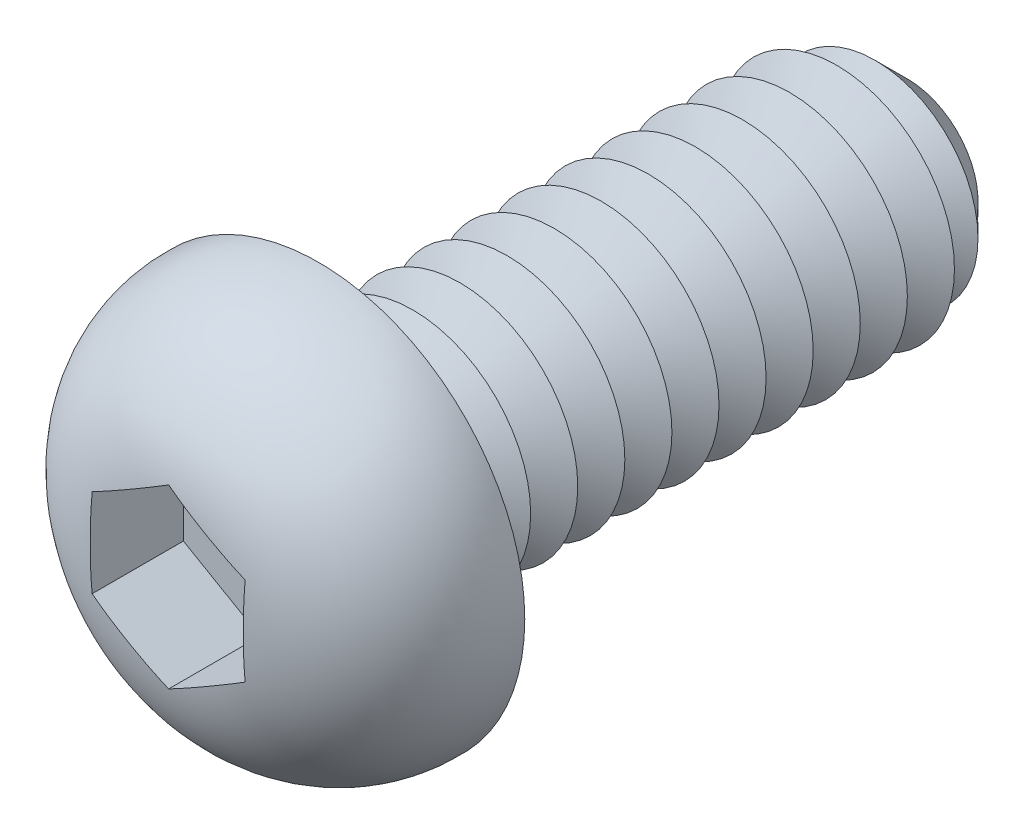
ISO-10303-21;
HEADER;
FILE_DESCRIPTION(('STEP AP214'),'2;1');
FILE_NAME('part.step','',(''),(''),'','','');
FILE_SCHEMA(('AUTOMOTIVE_DESIGN { 1 0 10303 214 1 1 1 1 }'));
ENDSEC;
DATA;
#1=APPLICATION_CONTEXT('core data for automotive mechanical design processes');
#2=APPLICATION_PROTOCOL_DEFINITION('international standard','automotive_design',2000,#1);
#3=PRODUCT_CONTEXT('',#1,'mechanical');
#4=PRODUCT('Part','Part','',(#3));
#5=PRODUCT_RELATED_PRODUCT_CATEGORY('part','',(#4));
#6=PRODUCT_DEFINITION_FORMATION('','',#4);
#7=PRODUCT_DEFINITION_CONTEXT('part definition',#1,'design');
#8=PRODUCT_DEFINITION('design','',#6,#7);
#9=PRODUCT_DEFINITION_SHAPE('','',#8);
#10=(LENGTH_UNIT() NAMED_UNIT(*) SI_UNIT(.MILLI.,.METRE.));
#11=(NAMED_UNIT(*) PLANE_ANGLE_UNIT() SI_UNIT($,.RADIAN.));
#12=(NAMED_UNIT(*) SI_UNIT($,.STERADIAN.) SOLID_ANGLE_UNIT());
#13=UNCERTAINTY_MEASURE_WITH_UNIT(LENGTH_MEASURE(1.E-05),#10,'distance_accuracy_value','');
#14=(GEOMETRIC_REPRESENTATION_CONTEXT(3) GLOBAL_UNCERTAINTY_ASSIGNED_CONTEXT((#13)) GLOBAL_UNIT_ASSIGNED_CONTEXT((#10,
#11,#12)) REPRESENTATION_CONTEXT('',''));
#15=CARTESIAN_POINT('',(0.,0.,0.));
#16=DIRECTION('',(0.,0.,1.));
#17=DIRECTION('',(1.,0.,0.));
#18=AXIS2_PLACEMENT_3D('',#15,#16,#17);
#19=CARTESIAN_POINT('',(0.,0.,-5.));
#20=DIRECTION('',(0.,0.,1.));
#21=DIRECTION('',(1.,0.,0.));
#22=AXIS2_PLACEMENT_3D('',#19,#20,#21);
#23=CYLINDRICAL_SURFACE('',#22,1.);
#24=CARTESIAN_POINT('',(0.,0.,-0.2));
#25=DIRECTION('',(0.,0.,1.));
#26=DIRECTION('',(1.,0.,0.));
#27=AXIS2_PLACEMENT_3D('',#24,#25,#26);
#28=CIRCLE('',#27,1.);
#29=CARTESIAN_POINT('',(1.,0.,-0.2));
#30=VERTEX_POINT('',#29);
#31=EDGE_CURVE('E48',#30,#30,#28,.F.);
#32=ORIENTED_EDGE('',*,*,#31,.T.);
#33=EDGE_LOOP('',(#32));
#34=FACE_BOUND('',#33,.T.);
#35=CARTESIAN_POINT('',(0.,0.,-0.399999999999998));
#36=DIRECTION('',(0.,0.,1.));
#37=DIRECTION('',(1.,0.,0.));
#38=AXIS2_PLACEMENT_3D('',#35,#36,#37);
#39=CIRCLE('',#38,1.);
#40=CARTESIAN_POINT('',(1.,0.,-0.399999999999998));
#41=VERTEX_POINT('',#40);
#42=EDGE_CURVE('E118',#41,#41,#39,.T.);
#43=ORIENTED_EDGE('',*,*,#42,.T.);
#44=EDGE_LOOP('',(#43));
#45=FACE_BOUND('',#44,.T.);
#46=ADVANCED_FACE('F39',(#34,#45),#23,.T.);
#47=CARTESIAN_POINT('',(0.,1.75,0.));
#48=DIRECTION('',(0.,0.,1.));
#49=DIRECTION('',(1.,0.,0.));
#50=AXIS2_PLACEMENT_3D('',#47,#48,#49);
#51=PLANE('',#50);
#52=CARTESIAN_POINT('',(0.,0.,0.));
#53=DIRECTION('',(0.,0.,1.));
#54=DIRECTION('',(1.,0.,0.));
#55=AXIS2_PLACEMENT_3D('',#52,#53,#54);
#56=CIRCLE('',#55,1.2);
#57=CARTESIAN_POINT('',(1.2,0.,0.));
#58=VERTEX_POINT('',#57);
#59=EDGE_CURVE('E11',#58,#58,#56,.T.);
#60=ORIENTED_EDGE('',*,*,#59,.T.);
#61=EDGE_LOOP('',(#60));
#62=FACE_BOUND('',#61,.T.);
#63=CARTESIAN_POINT('',(0.,0.,0.));
#64=DIRECTION('',(0.,0.,1.));
#65=DIRECTION('',(1.,0.,0.));
#66=AXIS2_PLACEMENT_3D('',#63,#64,#65);
#67=CIRCLE('',#66,1.75);
#68=CARTESIAN_POINT('',(1.75,0.,0.));
#69=VERTEX_POINT('',#68);
#70=EDGE_CURVE('E141',#69,#69,#67,.T.);
#71=ORIENTED_EDGE('',*,*,#70,.F.);
#72=EDGE_LOOP('',(#71));
#73=FACE_BOUND('',#72,.T.);
#74=ADVANCED_FACE('F223',(#62,#73),#51,.F.);
#75=CARTESIAN_POINT('',(0.,0.,0.0499999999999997));
#76=DIRECTION('',(0.,0.,1.));
#77=DIRECTION('',(1.,0.,0.));
#78=AXIS2_PLACEMENT_3D('',#75,#76,#77);
#79=DEGENERATE_TOROIDAL_SURFACE('',#78,0.50100040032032,1.25,.T.);
#80=CARTESIAN_POINT('',(-0.6502,0.375162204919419,1.2748120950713));
#81=CARTESIAN_POINT('',(-0.623166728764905,0.390769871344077,1.27799168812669));
#82=CARTESIAN_POINT('',(-0.596087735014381,0.406403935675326,1.28057383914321));
#83=CARTESIAN_POINT('',(-0.541883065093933,0.437699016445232,1.28476453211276));
#84=CARTESIAN_POINT('',(-0.514757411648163,0.453360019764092,1.28637345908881));
#85=CARTESIAN_POINT('',(-0.460533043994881,0.484666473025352,1.288838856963));
#86=CARTESIAN_POINT('',(-0.433434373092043,0.500311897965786,1.28969671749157));
#87=CARTESIAN_POINT('',(-0.379223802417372,0.531610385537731,1.29082127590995));
#88=CARTESIAN_POINT('',(-0.352111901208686,0.547263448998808,1.29108787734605));
#89=CARTESIAN_POINT('',(-0.297888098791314,0.578569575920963,1.29108787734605));
#90=CARTESIAN_POINT('',(-0.270776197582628,0.59422263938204,1.29082127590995));
#91=CARTESIAN_POINT('',(-0.216565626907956,0.625521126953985,1.28969671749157));
#92=CARTESIAN_POINT('',(-0.189466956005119,0.641166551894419,1.288838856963));
#93=CARTESIAN_POINT('',(-0.135242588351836,0.672473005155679,1.28637345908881));
#94=CARTESIAN_POINT('',(-0.108116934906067,0.688134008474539,1.28476453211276));
#95=CARTESIAN_POINT('',(-0.0539122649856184,0.719429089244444,1.28057383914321));
#96=CARTESIAN_POINT('',(-0.0268332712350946,0.735063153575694,1.27799168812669));
#97=CARTESIAN_POINT('',(0.000200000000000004,0.750670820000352,1.2748120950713));
#98=B_SPLINE_CURVE_WITH_KNOTS('',3,(#80,#81,#82,#83,#84,#85,#86,#87,#88,#89,#90,#91,#92,#93,#94,
#95,#96,#97),.UNSPECIFIED.,.F.,.F.,(4,2,2,2,2,2,2,2,4),(0.,0.0941133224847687,0.188189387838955,
0.282091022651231,0.376007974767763,0.469924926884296,0.563826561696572,0.657902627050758,
0.752015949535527),.UNSPECIFIED.);
#99=CARTESIAN_POINT('',(-0.65,0.375277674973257,1.27483563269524));
#100=VERTEX_POINT('',#99);
#101=CARTESIAN_POINT('',(0.,0.750555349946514,1.27483563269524));
#102=VERTEX_POINT('',#101);
#103=EDGE_CURVE('E158',#100,#102,#98,.T.);
#104=ORIENTED_EDGE('',*,*,#103,.T.);
#105=CARTESIAN_POINT('',(-0.000199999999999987,0.750670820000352,1.2748120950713));
#106=CARTESIAN_POINT('',(0.0268332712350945,0.735063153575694,1.27799168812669));
#107=CARTESIAN_POINT('',(0.0539122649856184,0.719429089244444,1.28057383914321));
#108=CARTESIAN_POINT('',(0.108116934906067,0.688134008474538,1.28476453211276));
#109=CARTESIAN_POINT('',(0.135242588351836,0.672473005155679,1.28637345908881));
#110=CARTESIAN_POINT('',(0.189466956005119,0.641166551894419,1.288838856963));
#111=CARTESIAN_POINT('',(0.216565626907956,0.625521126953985,1.28969671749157));
#112=CARTESIAN_POINT('',(0.270776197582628,0.59422263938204,1.29082127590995));
#113=CARTESIAN_POINT('',(0.297888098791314,0.578569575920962,1.29108787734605));
#114=CARTESIAN_POINT('',(0.352111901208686,0.547263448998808,1.29108787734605));
#115=CARTESIAN_POINT('',(0.379223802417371,0.531610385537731,1.29082127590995));
#116=CARTESIAN_POINT('',(0.433434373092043,0.500311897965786,1.28969671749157));
#117=CARTESIAN_POINT('',(0.46053304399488,0.484666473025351,1.288838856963));
#118=CARTESIAN_POINT('',(0.514757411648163,0.453360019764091,1.28637345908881));
#119=CARTESIAN_POINT('',(0.541883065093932,0.437699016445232,1.28476453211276));
#120=CARTESIAN_POINT('',(0.596087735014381,0.406403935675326,1.28057383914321));
#121=CARTESIAN_POINT('',(0.623166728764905,0.390769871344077,1.27799168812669));
#122=CARTESIAN_POINT('',(0.6502,0.375162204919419,1.2748120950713));
#123=B_SPLINE_CURVE_WITH_KNOTS('',3,(#105,#106,#107,#108,#109,#110,#111,#112,#113,#114,#115,
#116,#117,#118,#119,#120,#121,#122),.UNSPECIFIED.,.F.,.F.,(4,2,2,2,2,2,2,2,4),(0.,
0.0941133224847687,0.188189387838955,0.282091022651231,0.376007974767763,0.469924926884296,
0.563826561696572,0.657902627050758,0.752015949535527),.UNSPECIFIED.);
#124=CARTESIAN_POINT('',(0.65,0.375277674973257,1.27483563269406));
#125=VERTEX_POINT('',#124);
#126=EDGE_CURVE('E98',#102,#125,#123,.T.);
#127=ORIENTED_EDGE('',*,*,#126,.T.);
#128=CARTESIAN_POINT('',(0.65,0.,1.29108787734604));
#129=CARTESIAN_POINT('',(0.65,-0.0548046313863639,1.29109436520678));
#130=CARTESIAN_POINT('',(0.65,-0.109608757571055,1.29030350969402));
#131=CARTESIAN_POINT('',(0.65,-0.219170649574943,1.28661520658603));
#132=CARTESIAN_POINT('',(0.65,-0.273928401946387,1.28371727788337));
#133=CARTESIAN_POINT('',(0.65,-0.383095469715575,1.27460340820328));
#134=CARTESIAN_POINT('',(0.65,-0.437505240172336,1.26839356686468));
#135=CARTESIAN_POINT('',(0.65,-0.545599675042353,1.25147686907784));
#136=CARTESIAN_POINT('',(0.65,-0.599284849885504,1.24077336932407));
#137=CARTESIAN_POINT('',(0.65,-0.726147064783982,1.20871234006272));
#138=CARTESIAN_POINT('',(0.65,-0.79872007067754,1.18482363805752));
#139=CARTESIAN_POINT('',(0.65,-0.939044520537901,1.12544321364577));
#140=CARTESIAN_POINT('',(0.65,-1.00679500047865,1.08994917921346));
#141=CARTESIAN_POINT('',(0.65,-1.13535055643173,1.00723279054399));
#142=CARTESIAN_POINT('',(0.65,-1.19611172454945,0.959941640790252));
#143=CARTESIAN_POINT('',(0.65,-1.30775435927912,0.854818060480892));
#144=CARTESIAN_POINT('',(0.65,-1.35863681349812,0.796986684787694));
#145=CARTESIAN_POINT('',(0.65,-1.44408820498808,0.678594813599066));
#146=CARTESIAN_POINT('',(0.65,-1.4797502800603,0.618820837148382));
#147=CARTESIAN_POINT('',(0.65,-1.53998909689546,0.493937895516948));
#148=CARTESIAN_POINT('',(0.65,-1.56457069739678,0.428831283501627));
#149=CARTESIAN_POINT('',(0.65,-1.60096350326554,0.298259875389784));
#150=CARTESIAN_POINT('',(0.65,-1.61329238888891,0.232938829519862));
#151=CARTESIAN_POINT('',(0.65,-1.62664623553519,0.101147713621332));
#152=CARTESIAN_POINT('',(0.65,-1.6276715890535,0.0346776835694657));
#153=CARTESIAN_POINT('',(0.65,-1.6184464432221,-0.0965779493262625));
#154=CARTESIAN_POINT('',(0.65,-1.60834630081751,-0.161374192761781));
#155=CARTESIAN_POINT('',(0.65,-1.57743533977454,-0.288341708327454));
#156=CARTESIAN_POINT('',(0.65,-1.55662692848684,-0.350513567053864));
#157=CARTESIAN_POINT('',(0.65,-1.50490327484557,-0.470651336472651));
#158=CARTESIAN_POINT('',(0.65,-1.47396668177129,-0.528608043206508));
#159=CARTESIAN_POINT('',(0.65,-1.40295285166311,-0.63865943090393));
#160=CARTESIAN_POINT('',(0.65,-1.36286988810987,-0.690750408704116));
#161=CARTESIAN_POINT('',(0.65,-1.27395593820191,-0.788697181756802));
#162=CARTESIAN_POINT('',(0.65,-1.22497034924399,-0.834412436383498));
#163=CARTESIAN_POINT('',(0.65,-1.12042496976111,-0.917345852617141));
#164=CARTESIAN_POINT('',(0.65,-1.06487498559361,-0.954576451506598));
#165=CARTESIAN_POINT('',(0.65,-0.945822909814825,-1.02180899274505));
#166=CARTESIAN_POINT('',(0.65,-0.882060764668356,-1.05135028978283));
#167=CARTESIAN_POINT('',(0.65,-0.783687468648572,-1.08845195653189));
#168=CARTESIAN_POINT('',(0.65,-0.750379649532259,-1.09963089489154));
#169=CARTESIAN_POINT('',(0.65,-0.683093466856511,-1.11968224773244));
#170=CARTESIAN_POINT('',(0.65,-0.64911549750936,-1.12855597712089));
#171=CARTESIAN_POINT('',(0.65,-0.573025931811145,-1.14591124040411));
#172=CARTESIAN_POINT('',(0.65,-0.530794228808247,-1.15386155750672));
#173=CARTESIAN_POINT('',(0.65,-0.445896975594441,-1.16700727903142));
#174=CARTESIAN_POINT('',(0.65,-0.40323122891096,-1.17220137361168));
#175=CARTESIAN_POINT('',(0.65,-0.317562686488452,-1.18041063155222));
#176=CARTESIAN_POINT('',(0.65,-0.274559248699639,-1.18341875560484));
#177=CARTESIAN_POINT('',(0.65,-0.188468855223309,-1.18783962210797));
#178=CARTESIAN_POINT('',(0.65,-0.145381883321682,-1.1892520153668));
#179=CARTESIAN_POINT('',(0.65,-0.0590019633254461,-1.19095450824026));
#180=CARTESIAN_POINT('',(0.65,-0.0157089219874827,-1.19123978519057));
#181=CARTESIAN_POINT('',(0.65,0.0708684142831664,-1.1907952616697));
#182=CARTESIAN_POINT('',(0.65,0.114152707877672,-1.19006535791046));
#183=CARTESIAN_POINT('',(0.65,0.243756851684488,-1.18593769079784));
#184=CARTESIAN_POINT('',(0.65,0.330069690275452,-1.18060873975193));
#185=CARTESIAN_POINT('',(0.65,0.455654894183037,-1.16558903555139));
#186=CARTESIAN_POINT('',(0.65,0.495371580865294,-1.1597609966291));
#187=CARTESIAN_POINT('',(0.65,0.574346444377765,-1.14554740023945));
#188=CARTESIAN_POINT('',(0.65,0.613604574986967,-1.13716158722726));
#189=CARTESIAN_POINT('',(0.65,0.729813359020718,-1.10777161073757));
#190=CARTESIAN_POINT('',(0.65,0.805761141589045,-1.0824785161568));
#191=CARTESIAN_POINT('',(0.65,0.953092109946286,-1.01876094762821));
#192=CARTESIAN_POINT('',(0.65,1.02440985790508,-0.980183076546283));
#193=CARTESIAN_POINT('',(0.65,1.15871394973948,-0.890064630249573));
#194=CARTESIAN_POINT('',(0.65,1.22167627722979,-0.838487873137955));
#195=CARTESIAN_POINT('',(0.65,1.330165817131,-0.729868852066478));
#196=CARTESIAN_POINT('',(0.649999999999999,1.37682604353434,-0.673955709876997));
#197=CARTESIAN_POINT('',(0.649999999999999,1.45915796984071,-0.554638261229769));
#198=CARTESIAN_POINT('',(0.649999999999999,1.49484555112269,-0.491244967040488));
#199=CARTESIAN_POINT('',(0.649999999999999,1.55177809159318,-0.363813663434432));
#200=CARTESIAN_POINT('',(0.649999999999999,1.57388655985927,-0.300159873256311));
#201=CARTESIAN_POINT('',(0.649999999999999,1.60682450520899,-0.169982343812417));
#202=CARTESIAN_POINT('',(0.649999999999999,1.61765327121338,-0.103458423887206));
#203=CARTESIAN_POINT('',(0.649999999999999,1.62754441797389,0.0288862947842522));
#204=CARTESIAN_POINT('',(0.649999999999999,1.6268761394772,0.0946871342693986));
#205=CARTESIAN_POINT('',(0.649999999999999,1.61445465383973,0.225228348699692));
#206=CARTESIAN_POINT('',(0.649999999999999,1.60270257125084,0.289968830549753));
#207=CARTESIAN_POINT('',(0.649999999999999,1.56855547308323,0.416311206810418));
#208=CARTESIAN_POINT('',(0.649999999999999,1.54620091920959,0.477924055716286));
#209=CARTESIAN_POINT('',(0.649999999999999,1.49157336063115,0.596573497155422));
#210=CARTESIAN_POINT('',(0.649999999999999,1.459300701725,0.6536102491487));
#211=CARTESIAN_POINT('',(0.649999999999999,1.38544036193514,0.762206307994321));
#212=CARTESIAN_POINT('',(0.65,1.34375441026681,0.813698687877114));
#213=CARTESIAN_POINT('',(0.65,1.25257593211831,0.909229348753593));
#214=CARTESIAN_POINT('',(0.65,1.20308164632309,0.953265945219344));
#215=CARTESIAN_POINT('',(0.65,1.09600377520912,1.03435686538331));
#216=CARTESIAN_POINT('',(0.65,1.0382019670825,1.07112203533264));
#217=CARTESIAN_POINT('',(0.65,0.917680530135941,1.13527918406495));
#218=CARTESIAN_POINT('',(0.65,0.854963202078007,1.16267551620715));
#219=CARTESIAN_POINT('',(0.65,0.743153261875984,1.20242953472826));
#220=CARTESIAN_POINT('',(0.65,0.69477028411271,1.21684578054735));
#221=CARTESIAN_POINT('',(0.65,0.596867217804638,1.24115086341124));
#222=CARTESIAN_POINT('',(0.65,0.547346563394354,1.25103739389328));
#223=CARTESIAN_POINT('',(0.65,0.397729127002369,1.27492295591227));
#224=CARTESIAN_POINT('',(0.65,0.296733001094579,1.28309757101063));
#225=CARTESIAN_POINT('',(0.65,0.163130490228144,1.28863783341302));
#226=CARTESIAN_POINT('',(0.65,0.130510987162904,1.28957449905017));
#227=CARTESIAN_POINT('',(0.65,0.0652609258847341,1.29079749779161));
#228=CARTESIAN_POINT('',(0.65,0.0326303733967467,1.29108401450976));
#229=CARTESIAN_POINT('',(0.65,0.,1.29108787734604));
#230=B_SPLINE_CURVE_WITH_KNOTS('',3,(#128,#129,#130,#131,#132,#133,#134,#135,#136,#137,#138,
#139,#140,#141,#142,#143,#144,#145,#146,#147,#148,#149,#150,#151,#152,#153,#154,#155,#156,#157,
#158,#159,#160,#161,#162,#163,#164,#165,#166,#167,#168,#169,#170,#171,#172,#173,#174,#175,#176,
#177,#178,#179,#180,#181,#182,#183,#184,#185,#186,#187,#188,#189,#190,#191,#192,#193,#194,#195,
#196,#197,#198,#199,#200,#201,#202,#203,#204,#205,#206,#207,#208,#209,#210,#211,#212,#213,#214,
#215,#216,#217,#218,#219,#220,#221,#222,#223,#224,#225,#226,#227,#228,#229),.UNSPECIFIED.,.T.,
.F.,(4,2,2,2,2,2,2,2,2,2,2,2,2,2,2,2,2,2,2,2,2,2,2,2,2,2,2,2,2,2,2,2,2,2,2,2,2,2,2,2,2,2,2,2,2,
2,2,2,2,2,4),(0.,0.164404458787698,0.328846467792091,0.492986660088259,0.657004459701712,
0.885283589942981,1.11360822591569,1.34329681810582,1.57296243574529,1.78072081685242,
1.9883880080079,2.18685176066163,2.38530862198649,2.58111595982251,2.77687929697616,
2.97305799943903,3.16935986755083,3.36946935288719,3.5692835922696,3.77920028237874,
3.88453412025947,3.98980774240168,4.11861722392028,4.24748786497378,4.37677168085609,
4.50608378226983,4.63594858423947,4.76582660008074,5.02485743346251,5.14520715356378,
5.26556890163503,5.5046106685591,5.74651068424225,5.98909160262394,6.20640136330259,
6.42339510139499,6.62456294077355,6.82574346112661,7.02221748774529,7.21867158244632,
7.41438191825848,7.61008543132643,7.80793510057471,8.00582941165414,8.21046898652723,
8.41501334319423,8.56624321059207,8.71754999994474,9.02064941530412,9.11856257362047,
9.21644807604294),.UNSPECIFIED.);
#231=CARTESIAN_POINT('',(0.65,-0.375277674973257,1.27483563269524));
#232=VERTEX_POINT('',#231);
#233=EDGE_CURVE('E63',#125,#232,#230,.T.);
#234=ORIENTED_EDGE('',*,*,#233,.T.);
#235=CARTESIAN_POINT('',(0.6502,-0.375162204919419,1.2748120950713));
#236=CARTESIAN_POINT('',(0.623166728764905,-0.390769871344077,1.27799168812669));
#237=CARTESIAN_POINT('',(0.596087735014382,-0.406403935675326,1.28057383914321));
#238=CARTESIAN_POINT('',(0.541883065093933,-0.437699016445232,1.28476453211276));
#239=CARTESIAN_POINT('',(0.514757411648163,-0.453360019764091,1.28637345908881));
#240=CARTESIAN_POINT('',(0.460533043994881,-0.484666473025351,1.288838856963));
#241=CARTESIAN_POINT('',(0.433434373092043,-0.500311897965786,1.28969671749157));
#242=CARTESIAN_POINT('',(0.379223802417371,-0.531610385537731,1.29082127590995));
#243=CARTESIAN_POINT('',(0.352111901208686,-0.547263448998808,1.29108787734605));
#244=CARTESIAN_POINT('',(0.297888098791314,-0.578569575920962,1.29108787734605));
#245=CARTESIAN_POINT('',(0.270776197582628,-0.59422263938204,1.29082127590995));
#246=CARTESIAN_POINT('',(0.216565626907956,-0.625521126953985,1.28969671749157));
#247=CARTESIAN_POINT('',(0.189466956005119,-0.641166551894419,1.288838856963));
#248=CARTESIAN_POINT('',(0.135242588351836,-0.672473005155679,1.28637345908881));
#249=CARTESIAN_POINT('',(0.108116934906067,-0.688134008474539,1.28476453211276));
#250=CARTESIAN_POINT('',(0.0539122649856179,-0.719429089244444,1.28057383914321));
#251=CARTESIAN_POINT('',(0.026833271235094,-0.735063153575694,1.27799168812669));
#252=CARTESIAN_POINT('',(-0.000200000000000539,-0.750670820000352,1.2748120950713));
#253=B_SPLINE_CURVE_WITH_KNOTS('',3,(#235,#236,#237,#238,#239,#240,#241,#242,#243,#244,#245,
#246,#247,#248,#249,#250,#251,#252),.UNSPECIFIED.,.F.,.F.,(4,2,2,2,2,2,2,2,4),(0.,
0.0941133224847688,0.188189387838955,0.282091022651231,0.376007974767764,0.469924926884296,
0.563826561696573,0.657902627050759,0.752015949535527),.UNSPECIFIED.);
#254=CARTESIAN_POINT('',(0.,-0.750555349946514,1.27483563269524));
#255=VERTEX_POINT('',#254);
#256=EDGE_CURVE('E244',#232,#255,#253,.T.);
#257=ORIENTED_EDGE('',*,*,#256,.T.);
#258=CARTESIAN_POINT('',(0.000199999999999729,-0.750670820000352,1.2748120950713));
#259=CARTESIAN_POINT('',(-0.0268332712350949,-0.735063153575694,1.27799168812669));
#260=CARTESIAN_POINT('',(-0.0539122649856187,-0.719429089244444,1.28057383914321));
#261=CARTESIAN_POINT('',(-0.108116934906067,-0.688134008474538,1.28476453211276));
#262=CARTESIAN_POINT('',(-0.135242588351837,-0.672473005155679,1.28637345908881));
#263=CARTESIAN_POINT('',(-0.18946695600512,-0.641166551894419,1.288838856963));
#264=CARTESIAN_POINT('',(-0.216565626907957,-0.625521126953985,1.28969671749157));
#265=CARTESIAN_POINT('',(-0.270776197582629,-0.59422263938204,1.29082127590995));
#266=CARTESIAN_POINT('',(-0.297888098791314,-0.578569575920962,1.29108787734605));
#267=CARTESIAN_POINT('',(-0.352111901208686,-0.547263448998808,1.29108787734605));
#268=CARTESIAN_POINT('',(-0.379223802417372,-0.531610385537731,1.29082127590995));
#269=CARTESIAN_POINT('',(-0.433434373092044,-0.500311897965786,1.28969671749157));
#270=CARTESIAN_POINT('',(-0.460533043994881,-0.484666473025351,1.288838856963));
#271=CARTESIAN_POINT('',(-0.514757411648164,-0.453360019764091,1.28637345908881));
#272=CARTESIAN_POINT('',(-0.541883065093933,-0.437699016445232,1.28476453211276));
#273=CARTESIAN_POINT('',(-0.596087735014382,-0.406403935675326,1.28057383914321));
#274=CARTESIAN_POINT('',(-0.623166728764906,-0.390769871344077,1.27799168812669));
#275=CARTESIAN_POINT('',(-0.6502,-0.375162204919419,1.2748120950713));
#276=B_SPLINE_CURVE_WITH_KNOTS('',3,(#258,#259,#260,#261,#262,#263,#264,#265,#266,#267,#268,
#269,#270,#271,#272,#273,#274,#275),.UNSPECIFIED.,.F.,.F.,(4,2,2,2,2,2,2,2,4),(0.,
0.0941133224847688,0.188189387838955,0.282091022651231,0.376007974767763,0.469924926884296,
0.563826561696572,0.657902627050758,0.752015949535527),.UNSPECIFIED.);
#277=CARTESIAN_POINT('',(-0.65,-0.375277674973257,1.27483563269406));
#278=VERTEX_POINT('',#277);
#279=EDGE_CURVE('E250',#255,#278,#276,.T.);
#280=ORIENTED_EDGE('',*,*,#279,.T.);
#281=CARTESIAN_POINT('',(-0.65,0.,1.29108787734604));
#282=CARTESIAN_POINT('',(-0.65,0.0548046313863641,1.29109436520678));
#283=CARTESIAN_POINT('',(-0.65,0.109608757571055,1.29030350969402));
#284=CARTESIAN_POINT('',(-0.65,0.219170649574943,1.28661520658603));
#285=CARTESIAN_POINT('',(-0.65,0.273928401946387,1.28371727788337));
#286=CARTESIAN_POINT('',(-0.65,0.383095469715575,1.27460340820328));
#287=CARTESIAN_POINT('',(-0.65,0.437505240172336,1.26839356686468));
#288=CARTESIAN_POINT('',(-0.65,0.545599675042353,1.25147686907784));
#289=CARTESIAN_POINT('',(-0.65,0.599284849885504,1.24077336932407));
#290=CARTESIAN_POINT('',(-0.65,0.726147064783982,1.20871234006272));
#291=CARTESIAN_POINT('',(-0.65,0.79872007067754,1.18482363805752));
#292=CARTESIAN_POINT('',(-0.65,0.939044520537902,1.12544321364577));
#293=CARTESIAN_POINT('',(-0.65,1.00679500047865,1.08994917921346));
#294=CARTESIAN_POINT('',(-0.65,1.13535055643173,1.00723279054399));
#295=CARTESIAN_POINT('',(-0.65,1.19611172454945,0.959941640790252));
#296=CARTESIAN_POINT('',(-0.65,1.30775435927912,0.854818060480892));
#297=CARTESIAN_POINT('',(-0.649999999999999,1.35863681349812,0.796986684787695));
#298=CARTESIAN_POINT('',(-0.649999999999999,1.44408820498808,0.678594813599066));
#299=CARTESIAN_POINT('',(-0.649999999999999,1.4797502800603,0.618820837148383));
#300=CARTESIAN_POINT('',(-0.649999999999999,1.53998909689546,0.493937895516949));
#301=CARTESIAN_POINT('',(-0.649999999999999,1.56457069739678,0.428831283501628));
#302=CARTESIAN_POINT('',(-0.649999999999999,1.60096350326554,0.298259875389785));
#303=CARTESIAN_POINT('',(-0.649999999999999,1.61329238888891,0.232938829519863));
#304=CARTESIAN_POINT('',(-0.649999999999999,1.62664623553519,0.101147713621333));
#305=CARTESIAN_POINT('',(-0.649999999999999,1.6276715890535,0.0346776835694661));
#306=CARTESIAN_POINT('',(-0.649999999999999,1.6184464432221,-0.0965779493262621));
#307=CARTESIAN_POINT('',(-0.649999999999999,1.60834630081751,-0.16137419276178));
#308=CARTESIAN_POINT('',(-0.649999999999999,1.57743533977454,-0.288341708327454));
#309=CARTESIAN_POINT('',(-0.649999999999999,1.55662692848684,-0.350513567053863));
#310=CARTESIAN_POINT('',(-0.649999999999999,1.50490327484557,-0.47065133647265));
#311=CARTESIAN_POINT('',(-0.649999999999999,1.47396668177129,-0.528608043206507));
#312=CARTESIAN_POINT('',(-0.649999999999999,1.40295285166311,-0.638659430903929));
#313=CARTESIAN_POINT('',(-0.649999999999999,1.36286988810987,-0.690750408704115));
#314=CARTESIAN_POINT('',(-0.649999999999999,1.27395593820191,-0.788697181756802));
#315=CARTESIAN_POINT('',(-0.65,1.22497034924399,-0.834412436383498));
#316=CARTESIAN_POINT('',(-0.65,1.12042496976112,-0.91734585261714));
#317=CARTESIAN_POINT('',(-0.65,1.06487498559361,-0.954576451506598));
#318=CARTESIAN_POINT('',(-0.65,0.945822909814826,-1.02180899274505));
#319=CARTESIAN_POINT('',(-0.65,0.882060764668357,-1.05135028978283));
#320=CARTESIAN_POINT('',(-0.65,0.783687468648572,-1.08845195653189));
#321=CARTESIAN_POINT('',(-0.65,0.75037964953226,-1.09963089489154));
#322=CARTESIAN_POINT('',(-0.65,0.683093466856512,-1.11968224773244));
#323=CARTESIAN_POINT('',(-0.65,0.649115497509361,-1.12855597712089));
#324=CARTESIAN_POINT('',(-0.65,0.573025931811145,-1.14591124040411));
#325=CARTESIAN_POINT('',(-0.65,0.530794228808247,-1.15386155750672));
#326=CARTESIAN_POINT('',(-0.65,0.445896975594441,-1.16700727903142));
#327=CARTESIAN_POINT('',(-0.65,0.40323122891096,-1.17220137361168));
#328=CARTESIAN_POINT('',(-0.65,0.317562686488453,-1.18041063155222));
#329=CARTESIAN_POINT('',(-0.65,0.27455924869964,-1.18341875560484));
#330=CARTESIAN_POINT('',(-0.65,0.18846885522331,-1.18783962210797));
#331=CARTESIAN_POINT('',(-0.65,0.145381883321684,-1.1892520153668));
#332=CARTESIAN_POINT('',(-0.65,0.0590019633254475,-1.19095450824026));
#333=CARTESIAN_POINT('',(-0.65,0.0157089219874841,-1.19123978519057));
#334=CARTESIAN_POINT('',(-0.65,-0.070868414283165,-1.1907952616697));
#335=CARTESIAN_POINT('',(-0.65,-0.114152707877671,-1.19006535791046));
#336=CARTESIAN_POINT('',(-0.65,-0.243756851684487,-1.18593769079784));
#337=CARTESIAN_POINT('',(-0.65,-0.330069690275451,-1.18060873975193));
#338=CARTESIAN_POINT('',(-0.65,-0.455654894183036,-1.16558903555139));
#339=CARTESIAN_POINT('',(-0.65,-0.495371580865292,-1.1597609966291));
#340=CARTESIAN_POINT('',(-0.65,-0.574346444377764,-1.14554740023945));
#341=CARTESIAN_POINT('',(-0.65,-0.613604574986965,-1.13716158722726));
#342=CARTESIAN_POINT('',(-0.65,-0.729813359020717,-1.10777161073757));
#343=CARTESIAN_POINT('',(-0.65,-0.805761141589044,-1.0824785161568));
#344=CARTESIAN_POINT('',(-0.65,-0.953092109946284,-1.01876094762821));
#345=CARTESIAN_POINT('',(-0.65,-1.02440985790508,-0.980183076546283));
#346=CARTESIAN_POINT('',(-0.65,-1.15871394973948,-0.890064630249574));
#347=CARTESIAN_POINT('',(-0.65,-1.22167627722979,-0.838487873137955));
#348=CARTESIAN_POINT('',(-0.65,-1.330165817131,-0.729868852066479));
#349=CARTESIAN_POINT('',(-0.65,-1.37682604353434,-0.673955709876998));
#350=CARTESIAN_POINT('',(-0.65,-1.45915796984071,-0.55463826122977));
#351=CARTESIAN_POINT('',(-0.65,-1.49484555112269,-0.49124496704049));
#352=CARTESIAN_POINT('',(-0.65,-1.55177809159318,-0.363813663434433));
#353=CARTESIAN_POINT('',(-0.65,-1.57388655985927,-0.300159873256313));
#354=CARTESIAN_POINT('',(-0.65,-1.60682450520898,-0.169982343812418));
#355=CARTESIAN_POINT('',(-0.65,-1.61765327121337,-0.103458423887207));
#356=CARTESIAN_POINT('',(-0.65,-1.62754441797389,0.0288862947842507));
#357=CARTESIAN_POINT('',(-0.65,-1.6268761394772,0.0946871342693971));
#358=CARTESIAN_POINT('',(-0.65,-1.61445465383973,0.22522834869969));
#359=CARTESIAN_POINT('',(-0.65,-1.60270257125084,0.289968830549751));
#360=CARTESIAN_POINT('',(-0.65,-1.56855547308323,0.416311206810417));
#361=CARTESIAN_POINT('',(-0.65,-1.54620091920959,0.477924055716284));
#362=CARTESIAN_POINT('',(-0.65,-1.49157336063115,0.596573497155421));
#363=CARTESIAN_POINT('',(-0.65,-1.459300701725,0.653610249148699));
#364=CARTESIAN_POINT('',(-0.65,-1.38544036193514,0.762206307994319));
#365=CARTESIAN_POINT('',(-0.65,-1.34375441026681,0.813698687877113));
#366=CARTESIAN_POINT('',(-0.65,-1.25257593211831,0.909229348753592));
#367=CARTESIAN_POINT('',(-0.65,-1.20308164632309,0.953265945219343));
#368=CARTESIAN_POINT('',(-0.65,-1.09600377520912,1.03435686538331));
#369=CARTESIAN_POINT('',(-0.65,-1.0382019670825,1.07112203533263));
#370=CARTESIAN_POINT('',(-0.65,-0.917680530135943,1.13527918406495));
#371=CARTESIAN_POINT('',(-0.65,-0.854963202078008,1.16267551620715));
#372=CARTESIAN_POINT('',(-0.65,-0.743153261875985,1.20242953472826));
#373=CARTESIAN_POINT('',(-0.65,-0.694770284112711,1.21684578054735));
#374=CARTESIAN_POINT('',(-0.65,-0.596867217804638,1.24115086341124));
#375=CARTESIAN_POINT('',(-0.65,-0.547346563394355,1.25103739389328));
#376=CARTESIAN_POINT('',(-0.65,-0.39772912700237,1.27492295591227));
#377=CARTESIAN_POINT('',(-0.65,-0.296733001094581,1.28309757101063));
#378=CARTESIAN_POINT('',(-0.65,-0.163130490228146,1.28863783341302));
#379=CARTESIAN_POINT('',(-0.65,-0.130510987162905,1.28957449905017));
#380=CARTESIAN_POINT('',(-0.65,-0.0652609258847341,1.29079749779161));
#381=CARTESIAN_POINT('',(-0.65,-0.0326303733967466,1.29108401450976));
#382=CARTESIAN_POINT('',(-0.65,0.,1.29108787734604));
#383=B_SPLINE_CURVE_WITH_KNOTS('',3,(#281,#282,#283,#284,#285,#286,#287,#288,#289,#290,#291,
#292,#293,#294,#295,#296,#297,#298,#299,#300,#301,#302,#303,#304,#305,#306,#307,#308,#309,#310,
#311,#312,#313,#314,#315,#316,#317,#318,#319,#320,#321,#322,#323,#324,#325,#326,#327,#328,#329,
#330,#331,#332,#333,#334,#335,#336,#337,#338,#339,#340,#341,#342,#343,#344,#345,#346,#347,#348,
#349,#350,#351,#352,#353,#354,#355,#356,#357,#358,#359,#360,#361,#362,#363,#364,#365,#366,#367,
#368,#369,#370,#371,#372,#373,#374,#375,#376,#377,#378,#379,#380,#381,#382),.UNSPECIFIED.,.T.,
.F.,(4,2,2,2,2,2,2,2,2,2,2,2,2,2,2,2,2,2,2,2,2,2,2,2,2,2,2,2,2,2,2,2,2,2,2,2,2,2,2,2,2,2,2,2,2,
2,2,2,2,2,4),(0.,0.164404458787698,0.328846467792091,0.492986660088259,0.657004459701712,
0.885283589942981,1.11360822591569,1.34329681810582,1.57296243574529,1.78072081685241,
1.9883880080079,2.18685176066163,2.38530862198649,2.58111595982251,2.77687929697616,
2.97305799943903,3.16935986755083,3.36946935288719,3.5692835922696,3.77920028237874,
3.88453412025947,3.98980774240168,4.11861722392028,4.24748786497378,4.37677168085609,
4.50608378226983,4.63594858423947,4.76582660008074,5.02485743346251,5.14520715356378,
5.26556890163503,5.50461066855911,5.74651068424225,5.98909160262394,6.20640136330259,
6.42339510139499,6.62456294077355,6.82574346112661,7.02221748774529,7.21867158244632,
7.41438191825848,7.61008543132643,7.80793510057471,8.00582941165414,8.21046898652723,
8.41501334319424,8.56624321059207,8.71754999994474,9.02064941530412,9.11856257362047,
9.21644807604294),.UNSPECIFIED.);
#384=EDGE_CURVE('E166',#278,#100,#383,.T.);
#385=ORIENTED_EDGE('',*,*,#384,.T.);
#386=EDGE_LOOP('',(#104,#127,#234,#257,#280,#385));
#387=FACE_BOUND('',#386,.T.);
#388=ORIENTED_EDGE('',*,*,#70,.T.);
#389=EDGE_LOOP('',(#388));
#390=FACE_BOUND('',#389,.T.);
#391=ADVANCED_FACE('F171',(#387,#390),#79,.T.);
#392=CARTESIAN_POINT('',(0.65,0.375277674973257,0.5));
#393=DIRECTION('',(0.5,0.866025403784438,0.));
#394=DIRECTION('',(-0.866025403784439,0.5,0.));
#395=AXIS2_PLACEMENT_3D('',#392,#393,#394);
#396=PLANE('',#395);
#397=DIRECTION('',(0.,0.,1.));
#398=VECTOR('',#397,1.);
#399=CARTESIAN_POINT('',(0.,0.750555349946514,0.5));
#400=LINE('',#399,#398);
#401=CARTESIAN_POINT('',(0.,0.750555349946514,0.5));
#402=VERTEX_POINT('',#401);
#403=EDGE_CURVE('E55',#402,#102,#400,.T.);
#404=ORIENTED_EDGE('',*,*,#403,.F.);
#405=DIRECTION('',(-0.866025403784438,0.5,0.));
#406=VECTOR('',#405,1.);
#407=CARTESIAN_POINT('',(0.65,0.375277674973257,0.5));
#408=LINE('',#407,#406);
#409=CARTESIAN_POINT('',(0.65,0.375277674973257,0.5));
#410=VERTEX_POINT('',#409);
#411=EDGE_CURVE('E95',#410,#402,#408,.T.);
#412=ORIENTED_EDGE('',*,*,#411,.F.);
#413=DIRECTION('',(0.,0.,1.));
#414=VECTOR('',#413,1.);
#415=CARTESIAN_POINT('',(0.65,0.375277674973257,0.5));
#416=LINE('',#415,#414);
#417=EDGE_CURVE('E138',#410,#125,#416,.T.);
#418=ORIENTED_EDGE('',*,*,#417,.T.);
#419=ORIENTED_EDGE('',*,*,#126,.F.);
#420=EDGE_LOOP('',(#404,#412,#418,#419));
#421=FACE_BOUND('',#420,.T.);
#422=ADVANCED_FACE('F93',(#421),#396,.F.);
#423=CARTESIAN_POINT('',(0.65,-0.375277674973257,0.5));
#424=DIRECTION('',(1.,0.,0.));
#425=DIRECTION('',(0.,1.,0.));
#426=AXIS2_PLACEMENT_3D('',#423,#424,#425);
#427=PLANE('',#426);
#428=ORIENTED_EDGE('',*,*,#417,.F.);
#429=DIRECTION('',(0.,1.,0.));
#430=VECTOR('',#429,1.);
#431=CARTESIAN_POINT('',(0.65,-0.375277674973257,0.5));
#432=LINE('',#431,#430);
#433=CARTESIAN_POINT('',(0.65,-0.375277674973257,0.5));
#434=VERTEX_POINT('',#433);
#435=EDGE_CURVE('E102',#434,#410,#432,.T.);
#436=ORIENTED_EDGE('',*,*,#435,.F.);
#437=DIRECTION('',(0.,0.,1.));
#438=VECTOR('',#437,1.);
#439=CARTESIAN_POINT('',(0.65,-0.375277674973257,0.5));
#440=LINE('',#439,#438);
#441=EDGE_CURVE('E142',#434,#232,#440,.T.);
#442=ORIENTED_EDGE('',*,*,#441,.T.);
#443=ORIENTED_EDGE('',*,*,#233,.F.);
#444=EDGE_LOOP('',(#428,#436,#442,#443));
#445=FACE_BOUND('',#444,.T.);
#446=ADVANCED_FACE('F182',(#445),#427,.F.);
#447=CARTESIAN_POINT('',(0.,-0.750555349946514,0.5));
#448=DIRECTION('',(0.5,-0.866025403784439,0.));
#449=DIRECTION('',(0.866025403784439,0.5,0.));
#450=AXIS2_PLACEMENT_3D('',#447,#448,#449);
#451=PLANE('',#450);
#452=ORIENTED_EDGE('',*,*,#441,.F.);
#453=DIRECTION('',(0.866025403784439,0.5,0.));
#454=VECTOR('',#453,1.);
#455=CARTESIAN_POINT('',(0.,-0.750555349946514,0.5));
#456=LINE('',#455,#454);
#457=CARTESIAN_POINT('',(0.,-0.750555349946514,0.5));
#458=VERTEX_POINT('',#457);
#459=EDGE_CURVE('E133',#458,#434,#456,.T.);
#460=ORIENTED_EDGE('',*,*,#459,.F.);
#461=DIRECTION('',(0.,0.,1.));
#462=VECTOR('',#461,1.);
#463=CARTESIAN_POINT('',(0.,-0.750555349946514,0.5));
#464=LINE('',#463,#462);
#465=EDGE_CURVE('E145',#458,#255,#464,.T.);
#466=ORIENTED_EDGE('',*,*,#465,.T.);
#467=ORIENTED_EDGE('',*,*,#256,.F.);
#468=EDGE_LOOP('',(#452,#460,#466,#467));
#469=FACE_BOUND('',#468,.T.);
#470=ADVANCED_FACE('F238',(#469),#451,.F.);
#471=CARTESIAN_POINT('',(-0.65,-0.375277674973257,0.5));
#472=DIRECTION('',(-0.5,-0.866025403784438,0.));
#473=DIRECTION('',(0.866025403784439,-0.5,0.));
#474=AXIS2_PLACEMENT_3D('',#471,#472,#473);
#475=PLANE('',#474);
#476=ORIENTED_EDGE('',*,*,#465,.F.);
#477=DIRECTION('',(0.866025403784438,-0.5,0.));
#478=VECTOR('',#477,1.);
#479=CARTESIAN_POINT('',(-0.65,-0.375277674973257,0.5));
#480=LINE('',#479,#478);
#481=CARTESIAN_POINT('',(-0.65,-0.375277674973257,0.5));
#482=VERTEX_POINT('',#481);
#483=EDGE_CURVE('E129',#482,#458,#480,.T.);
#484=ORIENTED_EDGE('',*,*,#483,.F.);
#485=DIRECTION('',(0.,0.,1.));
#486=VECTOR('',#485,1.);
#487=CARTESIAN_POINT('',(-0.65,-0.375277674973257,0.5));
#488=LINE('',#487,#486);
#489=EDGE_CURVE('E149',#482,#278,#488,.T.);
#490=ORIENTED_EDGE('',*,*,#489,.T.);
#491=ORIENTED_EDGE('',*,*,#279,.F.);
#492=EDGE_LOOP('',(#476,#484,#490,#491));
#493=FACE_BOUND('',#492,.T.);
#494=ADVANCED_FACE('F241',(#493),#475,.F.);
#495=CARTESIAN_POINT('',(-0.65,0.375277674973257,0.5));
#496=DIRECTION('',(-1.,0.,0.));
#497=DIRECTION('',(0.,-1.,0.));
#498=AXIS2_PLACEMENT_3D('',#495,#496,#497);
#499=PLANE('',#498);
#500=ORIENTED_EDGE('',*,*,#489,.F.);
#501=DIRECTION('',(0.,-1.,0.));
#502=VECTOR('',#501,1.);
#503=CARTESIAN_POINT('',(-0.65,0.375277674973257,0.5));
#504=LINE('',#503,#502);
#505=CARTESIAN_POINT('',(-0.65,0.375277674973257,0.5));
#506=VERTEX_POINT('',#505);
#507=EDGE_CURVE('E112',#506,#482,#504,.T.);
#508=ORIENTED_EDGE('',*,*,#507,.F.);
#509=DIRECTION('',(0.,0.,1.));
#510=VECTOR('',#509,1.);
#511=CARTESIAN_POINT('',(-0.65,0.375277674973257,0.5));
#512=LINE('',#511,#510);
#513=EDGE_CURVE('E101',#506,#100,#512,.T.);
#514=ORIENTED_EDGE('',*,*,#513,.T.);
#515=ORIENTED_EDGE('',*,*,#384,.F.);
#516=EDGE_LOOP('',(#500,#508,#514,#515));
#517=FACE_BOUND('',#516,.T.);
#518=ADVANCED_FACE('F177',(#517),#499,.F.);
#519=CARTESIAN_POINT('',(0.,0.750555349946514,0.5));
#520=DIRECTION('',(-0.5,0.866025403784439,0.));
#521=DIRECTION('',(-0.866025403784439,-0.5,0.));
#522=AXIS2_PLACEMENT_3D('',#519,#520,#521);
#523=PLANE('',#522);
#524=ORIENTED_EDGE('',*,*,#513,.F.);
#525=DIRECTION('',(-0.866025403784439,-0.5,0.));
#526=VECTOR('',#525,1.);
#527=CARTESIAN_POINT('',(0.,0.750555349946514,0.5));
#528=LINE('',#527,#526);
#529=EDGE_CURVE('E105',#402,#506,#528,.T.);
#530=ORIENTED_EDGE('',*,*,#529,.F.);
#531=ORIENTED_EDGE('',*,*,#403,.T.);
#532=ORIENTED_EDGE('',*,*,#103,.F.);
#533=EDGE_LOOP('',(#524,#530,#531,#532));
#534=FACE_BOUND('',#533,.T.);
#535=ADVANCED_FACE('F106',(#534),#523,.F.);
#536=CARTESIAN_POINT('',(0.,0.,0.5));
#537=DIRECTION('',(0.,0.,1.));
#538=DIRECTION('',(1.,0.,0.));
#539=AXIS2_PLACEMENT_3D('',#536,#537,#538);
#540=PLANE('',#539);
#541=CARTESIAN_POINT('',(0.,0.,0.5));
#542=DIRECTION('',(0.,0.,1.));
#543=DIRECTION('',(1.,0.,0.));
#544=AXIS2_PLACEMENT_3D('',#541,#542,#543);
#545=CIRCLE('',#544,0.35);
#546=CARTESIAN_POINT('',(0.35,0.,0.5));
#547=VERTEX_POINT('',#546);
#548=EDGE_CURVE('E415',#547,#547,#545,.T.);
#549=ORIENTED_EDGE('',*,*,#548,.F.);
#550=EDGE_LOOP('',(#549));
#551=FACE_BOUND('',#550,.T.);
#552=ORIENTED_EDGE('',*,*,#411,.T.);
#553=ORIENTED_EDGE('',*,*,#529,.T.);
#554=ORIENTED_EDGE('',*,*,#507,.T.);
#555=ORIENTED_EDGE('',*,*,#483,.T.);
#556=ORIENTED_EDGE('',*,*,#459,.T.);
#557=ORIENTED_EDGE('',*,*,#435,.T.);
#558=EDGE_LOOP('',(#552,#553,#554,#555,#556,#557));
#559=FACE_BOUND('',#558,.T.);
#560=ADVANCED_FACE('F114',(#551,#559),#540,.T.);
#561=CARTESIAN_POINT('',(0.,0.,-0.399999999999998));
#562=DIRECTION('',(0.,0.,1.));
#563=DIRECTION('',(1.,0.,0.));
#564=AXIS2_PLACEMENT_3D('',#561,#562,#563);
#565=CONICAL_SURFACE('',#564,1.,1.04719755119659);
#566=CARTESIAN_POINT('',(0.,0.,-0.600000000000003));
#567=DIRECTION('',(0.,0.,1.));
#568=DIRECTION('',(1.,0.,0.));
#569=AXIS2_PLACEMENT_3D('',#566,#567,#568);
#570=CIRCLE('',#569,0.653589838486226);
#571=CARTESIAN_POINT('',(0.653589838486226,0.,-0.600000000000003));
#572=VERTEX_POINT('',#571);
#573=EDGE_CURVE('E123',#572,#572,#570,.T.);
#574=ORIENTED_EDGE('',*,*,#573,.T.);
#575=EDGE_LOOP('',(#574));
#576=FACE_BOUND('',#575,.T.);
#577=ORIENTED_EDGE('',*,*,#42,.F.);
#578=EDGE_LOOP('',(#577));
#579=FACE_BOUND('',#578,.T.);
#580=ADVANCED_FACE('F233',(#576,#579),#565,.T.);
#581=CARTESIAN_POINT('',(0.,0.,-0.600000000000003));
#582=DIRECTION('',(0.,0.,-1.));
#583=DIRECTION('',(-1.,0.,0.));
#584=AXIS2_PLACEMENT_3D('',#581,#582,#583);
#585=CONICAL_SURFACE('',#584,0.653589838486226,1.0471975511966);
#586=CARTESIAN_POINT('',(0.,0.,-0.799999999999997));
#587=DIRECTION('',(0.,0.,1.));
#588=DIRECTION('',(1.,0.,0.));
#589=AXIS2_PLACEMENT_3D('',#586,#587,#588);
#590=CIRCLE('',#589,1.);
#591=CARTESIAN_POINT('',(1.,0.,-0.799999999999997));
#592=VERTEX_POINT('',#591);
#593=EDGE_CURVE('E303',#592,#592,#590,.T.);
#594=ORIENTED_EDGE('',*,*,#593,.T.);
#595=EDGE_LOOP('',(#594));
#596=FACE_BOUND('',#595,.T.);
#597=ORIENTED_EDGE('',*,*,#573,.F.);
#598=EDGE_LOOP('',(#597));
#599=FACE_BOUND('',#598,.T.);
#600=ADVANCED_FACE('F312',(#596,#599),#585,.T.);
#601=CARTESIAN_POINT('',(0.,0.,-0.799999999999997));
#602=DIRECTION('',(0.,0.,1.));
#603=DIRECTION('',(1.,0.,0.));
#604=AXIS2_PLACEMENT_3D('',#601,#602,#603);
#605=CONICAL_SURFACE('',#604,1.,1.04719755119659);
#606=CARTESIAN_POINT('',(0.,0.,-1.));
#607=DIRECTION('',(0.,0.,1.));
#608=DIRECTION('',(1.,0.,0.));
#609=AXIS2_PLACEMENT_3D('',#606,#607,#608);
#610=CIRCLE('',#609,0.653589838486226);
#611=CARTESIAN_POINT('',(0.653589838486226,0.,-1.));
#612=VERTEX_POINT('',#611);
#613=EDGE_CURVE('E299',#612,#612,#610,.T.);
#614=ORIENTED_EDGE('',*,*,#613,.T.);
#615=EDGE_LOOP('',(#614));
#616=FACE_BOUND('',#615,.T.);
#617=ORIENTED_EDGE('',*,*,#593,.F.);
#618=EDGE_LOOP('',(#617));
#619=FACE_BOUND('',#618,.T.);
#620=ADVANCED_FACE('F314',(#616,#619),#605,.T.);
#621=CARTESIAN_POINT('',(0.,0.,-1.));
#622=DIRECTION('',(0.,0.,-1.));
#623=DIRECTION('',(-1.,0.,0.));
#624=AXIS2_PLACEMENT_3D('',#621,#622,#623);
#625=CONICAL_SURFACE('',#624,0.653589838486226,1.0471975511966);
#626=CARTESIAN_POINT('',(0.,0.,-1.2));
#627=DIRECTION('',(0.,0.,1.));
#628=DIRECTION('',(1.,0.,0.));
#629=AXIS2_PLACEMENT_3D('',#626,#627,#628);
#630=CIRCLE('',#629,1.);
#631=CARTESIAN_POINT('',(1.,0.,-1.2));
#632=VERTEX_POINT('',#631);
#633=EDGE_CURVE('E295',#632,#632,#630,.T.);
#634=ORIENTED_EDGE('',*,*,#633,.T.);
#635=EDGE_LOOP('',(#634));
#636=FACE_BOUND('',#635,.T.);
#637=ORIENTED_EDGE('',*,*,#613,.F.);
#638=EDGE_LOOP('',(#637));
#639=FACE_BOUND('',#638,.T.);
#640=ADVANCED_FACE('F321',(#636,#639),#625,.T.);
#641=CARTESIAN_POINT('',(0.,0.,-1.2));
#642=DIRECTION('',(0.,0.,1.));
#643=DIRECTION('',(1.,0.,0.));
#644=AXIS2_PLACEMENT_3D('',#641,#642,#643);
#645=CONICAL_SURFACE('',#644,1.,1.04719755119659);
#646=CARTESIAN_POINT('',(0.,0.,-1.4));
#647=DIRECTION('',(0.,0.,1.));
#648=DIRECTION('',(1.,0.,0.));
#649=AXIS2_PLACEMENT_3D('',#646,#647,#648);
#650=CIRCLE('',#649,0.653589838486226);
#651=CARTESIAN_POINT('',(0.653589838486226,0.,-1.4));
#652=VERTEX_POINT('',#651);
#653=EDGE_CURVE('E292',#652,#652,#650,.T.);
#654=ORIENTED_EDGE('',*,*,#653,.T.);
#655=EDGE_LOOP('',(#654));
#656=FACE_BOUND('',#655,.T.);
#657=ORIENTED_EDGE('',*,*,#633,.F.);
#658=EDGE_LOOP('',(#657));
#659=FACE_BOUND('',#658,.T.);
#660=ADVANCED_FACE('F327',(#656,#659),#645,.T.);
#661=CARTESIAN_POINT('',(0.,0.,-1.4));
#662=DIRECTION('',(0.,0.,-1.));
#663=DIRECTION('',(-1.,0.,0.));
#664=AXIS2_PLACEMENT_3D('',#661,#662,#663);
#665=CONICAL_SURFACE('',#664,0.653589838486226,1.0471975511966);
#666=CARTESIAN_POINT('',(0.,0.,-1.6));
#667=DIRECTION('',(0.,0.,1.));
#668=DIRECTION('',(1.,0.,0.));
#669=AXIS2_PLACEMENT_3D('',#666,#667,#668);
#670=CIRCLE('',#669,1.);
#671=CARTESIAN_POINT('',(1.,0.,-1.6));
#672=VERTEX_POINT('',#671);
#673=EDGE_CURVE('E288',#672,#672,#670,.T.);
#674=ORIENTED_EDGE('',*,*,#673,.T.);
#675=EDGE_LOOP('',(#674));
#676=FACE_BOUND('',#675,.T.);
#677=ORIENTED_EDGE('',*,*,#653,.F.);
#678=EDGE_LOOP('',(#677));
#679=FACE_BOUND('',#678,.T.);
#680=ADVANCED_FACE('F331',(#676,#679),#665,.T.);
#681=CARTESIAN_POINT('',(0.,0.,-1.6));
#682=DIRECTION('',(0.,0.,1.));
#683=DIRECTION('',(1.,0.,0.));
#684=AXIS2_PLACEMENT_3D('',#681,#682,#683);
#685=CONICAL_SURFACE('',#684,1.,1.04719755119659);
#686=CARTESIAN_POINT('',(0.,0.,-1.8));
#687=DIRECTION('',(0.,0.,1.));
#688=DIRECTION('',(1.,0.,0.));
#689=AXIS2_PLACEMENT_3D('',#686,#687,#688);
#690=CIRCLE('',#689,0.653589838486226);
#691=CARTESIAN_POINT('',(0.653589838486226,0.,-1.8));
#692=VERTEX_POINT('',#691);
#693=EDGE_CURVE('E277',#692,#692,#690,.T.);
#694=ORIENTED_EDGE('',*,*,#693,.T.);
#695=EDGE_LOOP('',(#694));
#696=FACE_BOUND('',#695,.T.);
#697=ORIENTED_EDGE('',*,*,#673,.F.);
#698=EDGE_LOOP('',(#697));
#699=FACE_BOUND('',#698,.T.);
#700=ADVANCED_FACE('F335',(#696,#699),#685,.T.);
#701=CARTESIAN_POINT('',(0.,0.,-1.8));
#702=DIRECTION('',(0.,0.,-1.));
#703=DIRECTION('',(-1.,0.,0.));
#704=AXIS2_PLACEMENT_3D('',#701,#702,#703);
#705=CONICAL_SURFACE('',#704,0.653589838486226,1.0471975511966);
#706=CARTESIAN_POINT('',(0.,0.,-2.));
#707=DIRECTION('',(0.,0.,1.));
#708=DIRECTION('',(1.,0.,0.));
#709=AXIS2_PLACEMENT_3D('',#706,#707,#708);
#710=CIRCLE('',#709,1.);
#711=CARTESIAN_POINT('',(1.,0.,-2.));
#712=VERTEX_POINT('',#711);
#713=EDGE_CURVE('E271',#712,#712,#710,.T.);
#714=ORIENTED_EDGE('',*,*,#713,.T.);
#715=EDGE_LOOP('',(#714));
#716=FACE_BOUND('',#715,.T.);
#717=ORIENTED_EDGE('',*,*,#693,.F.);
#718=EDGE_LOOP('',(#717));
#719=FACE_BOUND('',#718,.T.);
#720=ADVANCED_FACE('F339',(#716,#719),#705,.T.);
#721=CARTESIAN_POINT('',(0.,0.,-2.));
#722=DIRECTION('',(0.,0.,1.));
#723=DIRECTION('',(1.,0.,0.));
#724=AXIS2_PLACEMENT_3D('',#721,#722,#723);
#725=CONICAL_SURFACE('',#724,1.,1.04719755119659);
#726=CARTESIAN_POINT('',(0.,0.,-2.2));
#727=DIRECTION('',(0.,0.,1.));
#728=DIRECTION('',(1.,0.,0.));
#729=AXIS2_PLACEMENT_3D('',#726,#727,#728);
#730=CIRCLE('',#729,0.653589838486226);
#731=CARTESIAN_POINT('',(0.653589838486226,0.,-2.2));
#732=VERTEX_POINT('',#731);
#733=EDGE_CURVE('E269',#732,#732,#730,.T.);
#734=ORIENTED_EDGE('',*,*,#733,.T.);
#735=EDGE_LOOP('',(#734));
#736=FACE_BOUND('',#735,.T.);
#737=ORIENTED_EDGE('',*,*,#713,.F.);
#738=EDGE_LOOP('',(#737));
#739=FACE_BOUND('',#738,.T.);
#740=ADVANCED_FACE('F343',(#736,#739),#725,.T.);
#741=CARTESIAN_POINT('',(0.,0.,-2.2));
#742=DIRECTION('',(0.,0.,-1.));
#743=DIRECTION('',(-1.,0.,0.));
#744=AXIS2_PLACEMENT_3D('',#741,#742,#743);
#745=CONICAL_SURFACE('',#744,0.653589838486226,1.0471975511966);
#746=CARTESIAN_POINT('',(0.,0.,-2.4));
#747=DIRECTION('',(0.,0.,1.));
#748=DIRECTION('',(1.,0.,0.));
#749=AXIS2_PLACEMENT_3D('',#746,#747,#748);
#750=CIRCLE('',#749,1.);
#751=CARTESIAN_POINT('',(1.,0.,-2.4));
#752=VERTEX_POINT('',#751);
#753=EDGE_CURVE('E272',#752,#752,#750,.T.);
#754=ORIENTED_EDGE('',*,*,#753,.T.);
#755=EDGE_LOOP('',(#754));
#756=FACE_BOUND('',#755,.T.);
#757=ORIENTED_EDGE('',*,*,#733,.F.);
#758=EDGE_LOOP('',(#757));
#759=FACE_BOUND('',#758,.T.);
#760=ADVANCED_FACE('F347',(#756,#759),#745,.T.);
#761=CARTESIAN_POINT('',(0.,0.,-2.4));
#762=DIRECTION('',(0.,0.,1.));
#763=DIRECTION('',(1.,0.,0.));
#764=AXIS2_PLACEMENT_3D('',#761,#762,#763);
#765=CONICAL_SURFACE('',#764,1.,1.04719755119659);
#766=CARTESIAN_POINT('',(0.,0.,-2.6));
#767=DIRECTION('',(0.,0.,1.));
#768=DIRECTION('',(1.,0.,0.));
#769=AXIS2_PLACEMENT_3D('',#766,#767,#768);
#770=CIRCLE('',#769,0.653589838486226);
#771=CARTESIAN_POINT('',(0.653589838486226,0.,-2.6));
#772=VERTEX_POINT('',#771);
#773=EDGE_CURVE('E281',#772,#772,#770,.T.);
#774=ORIENTED_EDGE('',*,*,#773,.T.);
#775=EDGE_LOOP('',(#774));
#776=FACE_BOUND('',#775,.T.);
#777=ORIENTED_EDGE('',*,*,#753,.F.);
#778=EDGE_LOOP('',(#777));
#779=FACE_BOUND('',#778,.T.);
#780=ADVANCED_FACE('F350',(#776,#779),#765,.T.);
#781=CARTESIAN_POINT('',(0.,0.,-2.6));
#782=DIRECTION('',(0.,0.,-1.));
#783=DIRECTION('',(-1.,0.,0.));
#784=AXIS2_PLACEMENT_3D('',#781,#782,#783);
#785=CONICAL_SURFACE('',#784,0.653589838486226,1.0471975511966);
#786=CARTESIAN_POINT('',(0.,0.,-2.8));
#787=DIRECTION('',(0.,0.,1.));
#788=DIRECTION('',(1.,0.,0.));
#789=AXIS2_PLACEMENT_3D('',#786,#787,#788);
#790=CIRCLE('',#789,1.);
#791=CARTESIAN_POINT('',(1.,0.,-2.8));
#792=VERTEX_POINT('',#791);
#793=EDGE_CURVE('E444',#792,#792,#790,.T.);
#794=ORIENTED_EDGE('',*,*,#793,.T.);
#795=EDGE_LOOP('',(#794));
#796=FACE_BOUND('',#795,.T.);
#797=ORIENTED_EDGE('',*,*,#773,.F.);
#798=EDGE_LOOP('',(#797));
#799=FACE_BOUND('',#798,.T.);
#800=ADVANCED_FACE('F354',(#796,#799),#785,.T.);
#801=CARTESIAN_POINT('',(0.,0.,-2.8));
#802=DIRECTION('',(0.,0.,1.));
#803=DIRECTION('',(1.,0.,0.));
#804=AXIS2_PLACEMENT_3D('',#801,#802,#803);
#805=CONICAL_SURFACE('',#804,1.,1.04719755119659);
#806=CARTESIAN_POINT('',(0.,0.,-3.));
#807=DIRECTION('',(0.,0.,1.));
#808=DIRECTION('',(1.,0.,0.));
#809=AXIS2_PLACEMENT_3D('',#806,#807,#808);
#810=CIRCLE('',#809,0.653589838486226);
#811=CARTESIAN_POINT('',(0.653589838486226,0.,-3.));
#812=VERTEX_POINT('',#811);
#813=EDGE_CURVE('E440',#812,#812,#810,.T.);
#814=ORIENTED_EDGE('',*,*,#813,.T.);
#815=EDGE_LOOP('',(#814));
#816=FACE_BOUND('',#815,.T.);
#817=ORIENTED_EDGE('',*,*,#793,.F.);
#818=EDGE_LOOP('',(#817));
#819=FACE_BOUND('',#818,.T.);
#820=ADVANCED_FACE('F358',(#816,#819),#805,.T.);
#821=CARTESIAN_POINT('',(0.,0.,-3.));
#822=DIRECTION('',(0.,0.,-1.));
#823=DIRECTION('',(-1.,0.,0.));
#824=AXIS2_PLACEMENT_3D('',#821,#822,#823);
#825=CONICAL_SURFACE('',#824,0.653589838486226,1.0471975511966);
#826=CARTESIAN_POINT('',(0.,0.,-3.2));
#827=DIRECTION('',(0.,0.,1.));
#828=DIRECTION('',(1.,0.,0.));
#829=AXIS2_PLACEMENT_3D('',#826,#827,#828);
#830=CIRCLE('',#829,1.);
#831=CARTESIAN_POINT('',(1.,0.,-3.2));
#832=VERTEX_POINT('',#831);
#833=EDGE_CURVE('E437',#832,#832,#830,.T.);
#834=ORIENTED_EDGE('',*,*,#833,.T.);
#835=EDGE_LOOP('',(#834));
#836=FACE_BOUND('',#835,.T.);
#837=ORIENTED_EDGE('',*,*,#813,.F.);
#838=EDGE_LOOP('',(#837));
#839=FACE_BOUND('',#838,.T.);
#840=ADVANCED_FACE('F362',(#836,#839),#825,.T.);
#841=CARTESIAN_POINT('',(0.,0.,-3.2));
#842=DIRECTION('',(0.,0.,1.));
#843=DIRECTION('',(1.,0.,0.));
#844=AXIS2_PLACEMENT_3D('',#841,#842,#843);
#845=CONICAL_SURFACE('',#844,1.,1.04719755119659);
#846=CARTESIAN_POINT('',(0.,0.,-3.4));
#847=DIRECTION('',(0.,0.,1.));
#848=DIRECTION('',(1.,0.,0.));
#849=AXIS2_PLACEMENT_3D('',#846,#847,#848);
#850=CIRCLE('',#849,0.653589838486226);
#851=CARTESIAN_POINT('',(0.653589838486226,0.,-3.4));
#852=VERTEX_POINT('',#851);
#853=EDGE_CURVE('E433',#852,#852,#850,.T.);
#854=ORIENTED_EDGE('',*,*,#853,.T.);
#855=EDGE_LOOP('',(#854));
#856=FACE_BOUND('',#855,.T.);
#857=ORIENTED_EDGE('',*,*,#833,.F.);
#858=EDGE_LOOP('',(#857));
#859=FACE_BOUND('',#858,.T.);
#860=ADVANCED_FACE('F366',(#856,#859),#845,.T.);
#861=CARTESIAN_POINT('',(0.,0.,-3.4));
#862=DIRECTION('',(0.,0.,-1.));
#863=DIRECTION('',(-1.,0.,0.));
#864=AXIS2_PLACEMENT_3D('',#861,#862,#863);
#865=CONICAL_SURFACE('',#864,0.653589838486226,1.0471975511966);
#866=CARTESIAN_POINT('',(0.,0.,-3.6));
#867=DIRECTION('',(0.,0.,1.));
#868=DIRECTION('',(1.,0.,0.));
#869=AXIS2_PLACEMENT_3D('',#866,#867,#868);
#870=CIRCLE('',#869,1.);
#871=CARTESIAN_POINT('',(1.,0.,-3.6));
#872=VERTEX_POINT('',#871);
#873=EDGE_CURVE('E429',#872,#872,#870,.T.);
#874=ORIENTED_EDGE('',*,*,#873,.T.);
#875=EDGE_LOOP('',(#874));
#876=FACE_BOUND('',#875,.T.);
#877=ORIENTED_EDGE('',*,*,#853,.F.);
#878=EDGE_LOOP('',(#877));
#879=FACE_BOUND('',#878,.T.);
#880=ADVANCED_FACE('F370',(#876,#879),#865,.T.);
#881=CARTESIAN_POINT('',(0.,0.,-3.6));
#882=DIRECTION('',(0.,0.,1.));
#883=DIRECTION('',(1.,0.,0.));
#884=AXIS2_PLACEMENT_3D('',#881,#882,#883);
#885=CONICAL_SURFACE('',#884,1.,1.04719755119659);
#886=CARTESIAN_POINT('',(0.,0.,-3.8));
#887=DIRECTION('',(0.,0.,1.));
#888=DIRECTION('',(1.,0.,0.));
#889=AXIS2_PLACEMENT_3D('',#886,#887,#888);
#890=CIRCLE('',#889,0.653589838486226);
#891=CARTESIAN_POINT('',(0.653589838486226,0.,-3.8));
#892=VERTEX_POINT('',#891);
#893=EDGE_CURVE('E426',#892,#892,#890,.T.);
#894=ORIENTED_EDGE('',*,*,#893,.T.);
#895=EDGE_LOOP('',(#894));
#896=FACE_BOUND('',#895,.T.);
#897=ORIENTED_EDGE('',*,*,#873,.F.);
#898=EDGE_LOOP('',(#897));
#899=FACE_BOUND('',#898,.T.);
#900=ADVANCED_FACE('F374',(#896,#899),#885,.T.);
#901=CARTESIAN_POINT('',(0.,0.,-3.8));
#902=DIRECTION('',(0.,0.,-1.));
#903=DIRECTION('',(-1.,0.,0.));
#904=AXIS2_PLACEMENT_3D('',#901,#902,#903);
#905=CONICAL_SURFACE('',#904,0.653589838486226,1.0471975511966);
#906=CARTESIAN_POINT('',(0.,0.,-4.));
#907=DIRECTION('',(0.,0.,1.));
#908=DIRECTION('',(1.,0.,0.));
#909=AXIS2_PLACEMENT_3D('',#906,#907,#908);
#910=CIRCLE('',#909,1.);
#911=CARTESIAN_POINT('',(1.,0.,-4.));
#912=VERTEX_POINT('',#911);
#913=EDGE_CURVE('E422',#912,#912,#910,.T.);
#914=ORIENTED_EDGE('',*,*,#913,.T.);
#915=EDGE_LOOP('',(#914));
#916=FACE_BOUND('',#915,.T.);
#917=ORIENTED_EDGE('',*,*,#893,.F.);
#918=EDGE_LOOP('',(#917));
#919=FACE_BOUND('',#918,.T.);
#920=ADVANCED_FACE('F378',(#916,#919),#905,.T.);
#921=CARTESIAN_POINT('',(0.,0.,-4.));
#922=DIRECTION('',(0.,0.,1.));
#923=DIRECTION('',(1.,0.,0.));
#924=AXIS2_PLACEMENT_3D('',#921,#922,#923);
#925=CONICAL_SURFACE('',#924,1.,1.04719755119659);
#926=CARTESIAN_POINT('',(0.,0.,-4.2));
#927=DIRECTION('',(0.,0.,1.));
#928=DIRECTION('',(1.,0.,0.));
#929=AXIS2_PLACEMENT_3D('',#926,#927,#928);
#930=CIRCLE('',#929,0.653589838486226);
#931=CARTESIAN_POINT('',(0.653589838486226,0.,-4.2));
#932=VERTEX_POINT('',#931);
#933=EDGE_CURVE('E201',#932,#932,#930,.T.);
#934=ORIENTED_EDGE('',*,*,#933,.T.);
#935=EDGE_LOOP('',(#934));
#936=FACE_BOUND('',#935,.T.);
#937=ORIENTED_EDGE('',*,*,#913,.F.);
#938=EDGE_LOOP('',(#937));
#939=FACE_BOUND('',#938,.T.);
#940=ADVANCED_FACE('F382',(#936,#939),#925,.T.);
#941=CARTESIAN_POINT('',(0.,0.,-4.2));
#942=DIRECTION('',(0.,0.,-1.));
#943=DIRECTION('',(-1.,0.,0.));
#944=AXIS2_PLACEMENT_3D('',#941,#942,#943);
#945=CONICAL_SURFACE('',#944,0.653589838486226,1.0471975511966);
#946=CARTESIAN_POINT('',(0.,0.,-4.4));
#947=DIRECTION('',(0.,0.,1.));
#948=DIRECTION('',(1.,0.,0.));
#949=AXIS2_PLACEMENT_3D('',#946,#947,#948);
#950=CIRCLE('',#949,1.);
#951=CARTESIAN_POINT('',(1.,0.,-4.4));
#952=VERTEX_POINT('',#951);
#953=EDGE_CURVE('E202',#952,#952,#950,.T.);
#954=ORIENTED_EDGE('',*,*,#953,.T.);
#955=EDGE_LOOP('',(#954));
#956=FACE_BOUND('',#955,.T.);
#957=ORIENTED_EDGE('',*,*,#933,.F.);
#958=EDGE_LOOP('',(#957));
#959=FACE_BOUND('',#958,.T.);
#960=ADVANCED_FACE('F386',(#956,#959),#945,.T.);
#961=CARTESIAN_POINT('',(0.,0.,-4.4));
#962=DIRECTION('',(0.,0.,1.));
#963=DIRECTION('',(1.,0.,0.));
#964=AXIS2_PLACEMENT_3D('',#961,#962,#963);
#965=CONICAL_SURFACE('',#964,1.,1.04719755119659);
#966=CARTESIAN_POINT('',(0.,0.,-4.6));
#967=DIRECTION('',(0.,0.,1.));
#968=DIRECTION('',(1.,0.,0.));
#969=AXIS2_PLACEMENT_3D('',#966,#967,#968);
#970=CIRCLE('',#969,0.653589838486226);
#971=CARTESIAN_POINT('',(0.653589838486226,0.,-4.6));
#972=VERTEX_POINT('',#971);
#973=EDGE_CURVE('E406',#972,#972,#970,.T.);
#974=ORIENTED_EDGE('',*,*,#973,.T.);
#975=EDGE_LOOP('',(#974));
#976=FACE_BOUND('',#975,.T.);
#977=ORIENTED_EDGE('',*,*,#953,.F.);
#978=EDGE_LOOP('',(#977));
#979=FACE_BOUND('',#978,.T.);
#980=ADVANCED_FACE('F390',(#976,#979),#965,.T.);
#981=CARTESIAN_POINT('',(0.,0.,-4.6));
#982=DIRECTION('',(0.,0.,-1.));
#983=DIRECTION('',(-1.,0.,0.));
#984=AXIS2_PLACEMENT_3D('',#981,#982,#983);
#985=CONICAL_SURFACE('',#984,0.653589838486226,1.0471975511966);
#986=CARTESIAN_POINT('',(0.,0.,-4.72679491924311));
#987=DIRECTION('',(0.,0.,-1.));
#988=DIRECTION('',(-1.,0.,0.));
#989=AXIS2_PLACEMENT_3D('',#986,#987,#988);
#990=CIRCLE('',#989,0.873205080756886);
#991=CARTESIAN_POINT('',(-0.873205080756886,0.,-4.72679491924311));
#992=VERTEX_POINT('',#991);
#993=EDGE_CURVE('E198',#992,#992,#990,.T.);
#994=ORIENTED_EDGE('',*,*,#993,.F.);
#995=EDGE_LOOP('',(#994));
#996=FACE_BOUND('',#995,.T.);
#997=ORIENTED_EDGE('',*,*,#973,.F.);
#998=EDGE_LOOP('',(#997));
#999=FACE_BOUND('',#998,.T.);
#1000=ADVANCED_FACE('F394',(#996,#999),#985,.T.);
#1001=CARTESIAN_POINT('',(0.,0.,-5.));
#1002=DIRECTION('',(0.,0.,-1.));
#1003=DIRECTION('',(-1.,0.,0.));
#1004=AXIS2_PLACEMENT_3D('',#1001,#1002,#1003);
#1005=PLANE('',#1004);
#1006=CARTESIAN_POINT('',(0.,0.,-5.));
#1007=DIRECTION('',(0.,0.,-1.));
#1008=DIRECTION('',(-1.,0.,0.));
#1009=AXIS2_PLACEMENT_3D('',#1006,#1007,#1008);
#1010=CIRCLE('',#1009,0.35);
#1011=CARTESIAN_POINT('',(-0.35,0.,-5.));
#1012=VERTEX_POINT('',#1011);
#1013=EDGE_CURVE('E408',#1012,#1012,#1010,.F.);
#1014=ORIENTED_EDGE('',*,*,#1013,.T.);
#1015=EDGE_LOOP('',(#1014));
#1016=FACE_BOUND('',#1015,.T.);
#1017=CARTESIAN_POINT('',(0.,0.,-5.));
#1018=DIRECTION('',(0.,0.,-1.));
#1019=DIRECTION('',(-1.,0.,0.));
#1020=AXIS2_PLACEMENT_3D('',#1017,#1018,#1019);
#1021=CIRCLE('',#1020,0.6);
#1022=CARTESIAN_POINT('',(-0.6,0.,-5.));
#1023=VERTEX_POINT('',#1022);
#1024=EDGE_CURVE('E190',#1023,#1023,#1021,.T.);
#1025=ORIENTED_EDGE('',*,*,#1024,.T.);
#1026=EDGE_LOOP('',(#1025));
#1027=FACE_BOUND('',#1026,.T.);
#1028=ADVANCED_FACE('F219',(#1016,#1027),#1005,.T.);
#1029=CARTESIAN_POINT('',(0.,0.,-5.));
#1030=DIRECTION('',(0.,0.,1.));
#1031=DIRECTION('',(1.,0.,0.));
#1032=AXIS2_PLACEMENT_3D('',#1029,#1030,#1031);
#1033=CONICAL_SURFACE('',#1032,0.6,0.785398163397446);
#1034=ORIENTED_EDGE('',*,*,#1024,.F.);
#1035=EDGE_LOOP('',(#1034));
#1036=FACE_BOUND('',#1035,.T.);
#1037=ORIENTED_EDGE('',*,*,#993,.T.);
#1038=EDGE_LOOP('',(#1037));
#1039=FACE_BOUND('',#1038,.T.);
#1040=ADVANCED_FACE('F211',(#1036,#1039),#1033,.T.);
#1041=CARTESIAN_POINT('',(0.,0.,-0.2));
#1042=DIRECTION('',(0.,0.,1.));
#1043=DIRECTION('',(1.,0.,0.));
#1044=AXIS2_PLACEMENT_3D('',#1041,#1042,#1043);
#1045=TOROIDAL_SURFACE('',#1044,1.2,0.2);
#1046=ORIENTED_EDGE('',*,*,#59,.F.);
#1047=EDGE_LOOP('',(#1046));
#1048=FACE_BOUND('',#1047,.T.);
#1049=ORIENTED_EDGE('',*,*,#31,.F.);
#1050=EDGE_LOOP('',(#1049));
#1051=FACE_BOUND('',#1050,.T.);
#1052=ADVANCED_FACE('F41',(#1048,#1051),#1045,.F.);
#1053=CARTESIAN_POINT('',(0.,0.,-5.98994949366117));
#1054=DIRECTION('',(0.,0.,1.));
#1055=DIRECTION('',(1.,0.,0.));
#1056=AXIS2_PLACEMENT_3D('',#1053,#1054,#1055);
#1057=CYLINDRICAL_SURFACE('',#1056,0.35);
#1058=ORIENTED_EDGE('',*,*,#548,.T.);
#1059=EDGE_LOOP('',(#1058));
#1060=FACE_BOUND('',#1059,.T.);
#1061=ORIENTED_EDGE('',*,*,#1013,.F.);
#1062=EDGE_LOOP('',(#1061));
#1063=FACE_BOUND('',#1062,.T.);
#1064=ADVANCED_FACE('F210',(#1060,#1063),#1057,.F.);
#1065=CLOSED_SHELL('',(#46,#74,#391,#422,#446,#470,#494,#518,#535,#560,#580,#600,#620,#640,#660,
#680,#700,#720,#740,#760,#780,#800,#820,#840,#860,#880,#900,#920,#940,#960,#980,#1000,#1028,
#1040,#1052,#1064));
#1066=MANIFOLD_SOLID_BREP('B2',#1065);
#1067=ADVANCED_BREP_SHAPE_REPRESENTATION('',(#18,#1066),#14);
#1068=SHAPE_DEFINITION_REPRESENTATION(#9,#1067);
ENDSEC;
END-ISO-10303-21;
